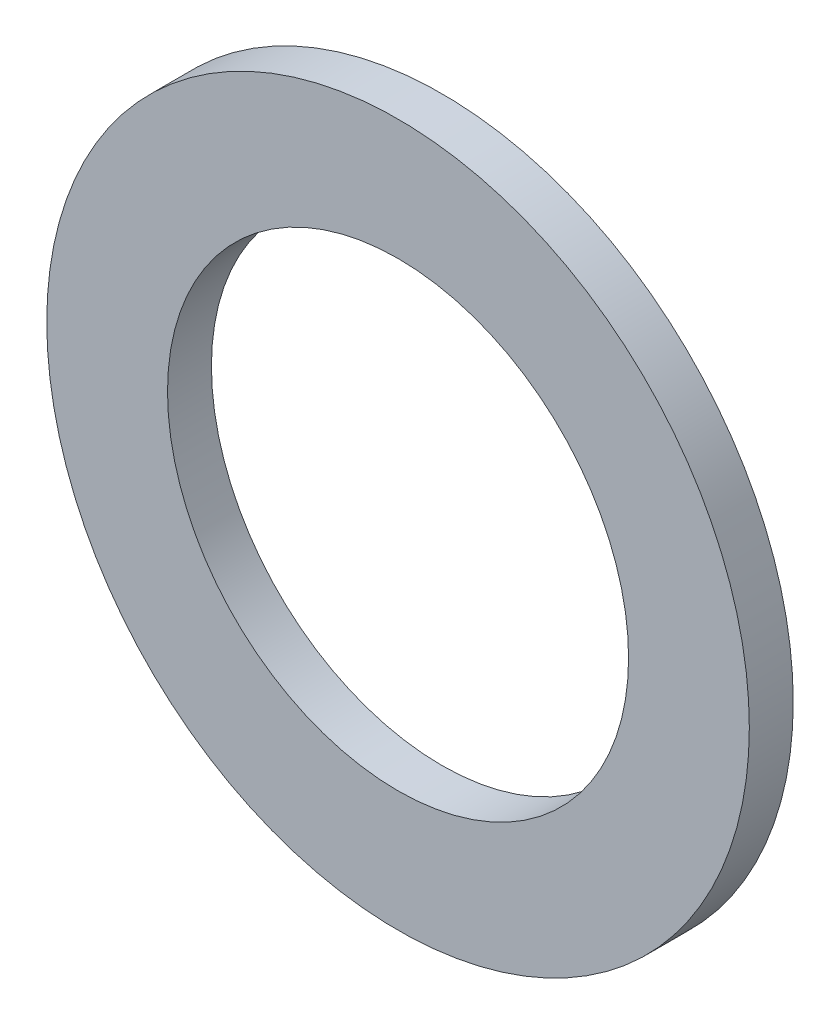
from build123d import *

# Parameters (mm, degrees)
ESQUISSE1_R        = 8
ESQUISSE1_R_2      = 5.25
BOSS_EXTRU_1_DEPTH = 1


with BuildPart() as part:
    # Esquisse1 → Boss.-Extru.1 (new body)
    with BuildSketch(Plane.XY):
        Circle(ESQUISSE1_R)
        Circle(ESQUISSE1_R_2, mode=Mode.SUBTRACT)
    extrude(amount=-BOSS_EXTRU_1_DEPTH)


solid = part.part
